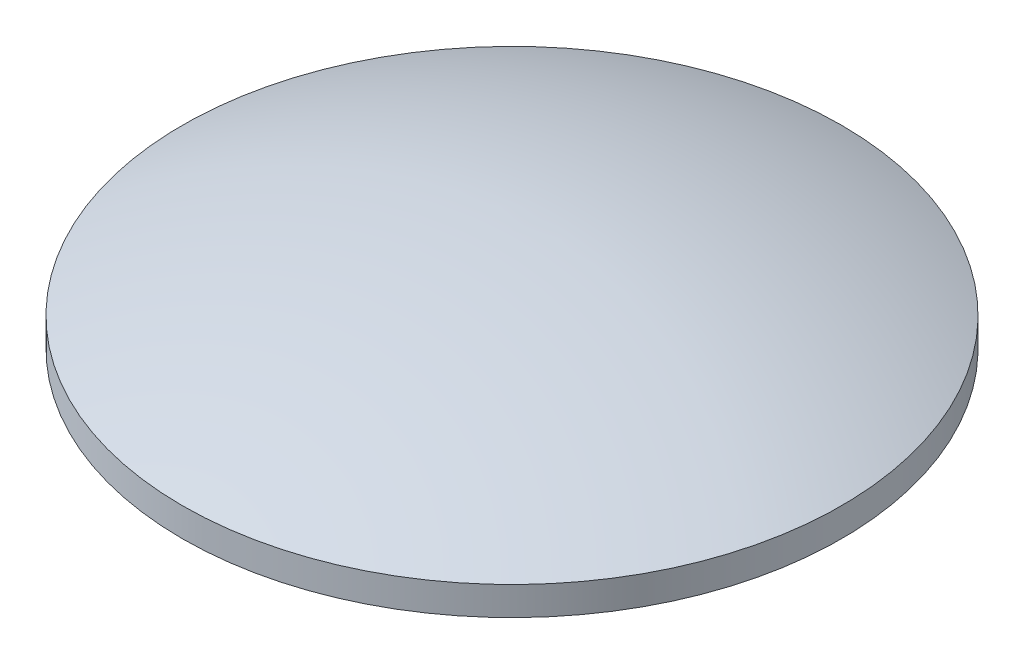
from build123d import *

# Parameters (mm, degrees)
SKETCH1_R         = 2.921
EXTRUDE1_DEPTH    = 0.254
DOME1_FACE_RADIUS = 2.921
DOME1_HEIGHT      = 0.635


with BuildPart() as part:
    # Sketch1 → Extrude1 (new body)
    with BuildSketch(Plane(origin=(0, 0, 0), x_dir=(1, 0, 0), z_dir=(0, 1, 0))):
        with Locations(Location((0, 0, 0), (0, 0, 270))):
            Circle(SKETCH1_R)
    extrude(amount=EXTRUDE1_DEPTH)

    # Dome1: a dome of height H over a round flat face of radius A is a cap of a sphere of radius (A * A + H * H) / (2 * H)
    dome1_r = (DOME1_FACE_RADIUS * DOME1_FACE_RADIUS + DOME1_HEIGHT * DOME1_HEIGHT) / (2 * DOME1_HEIGHT)
    dome1_base = Plane((0, 0.254, 0), z_dir=(0, 1, 0))
    with Locations(dome1_base.offset(DOME1_HEIGHT - dome1_r)):
        dome1_ball = Sphere(dome1_r, mode=Mode.PRIVATE)
    add(split(dome1_ball, bisect_by=dome1_base, keep=Keep.TOP, mode=Mode.PRIVATE))


solid = part.part
